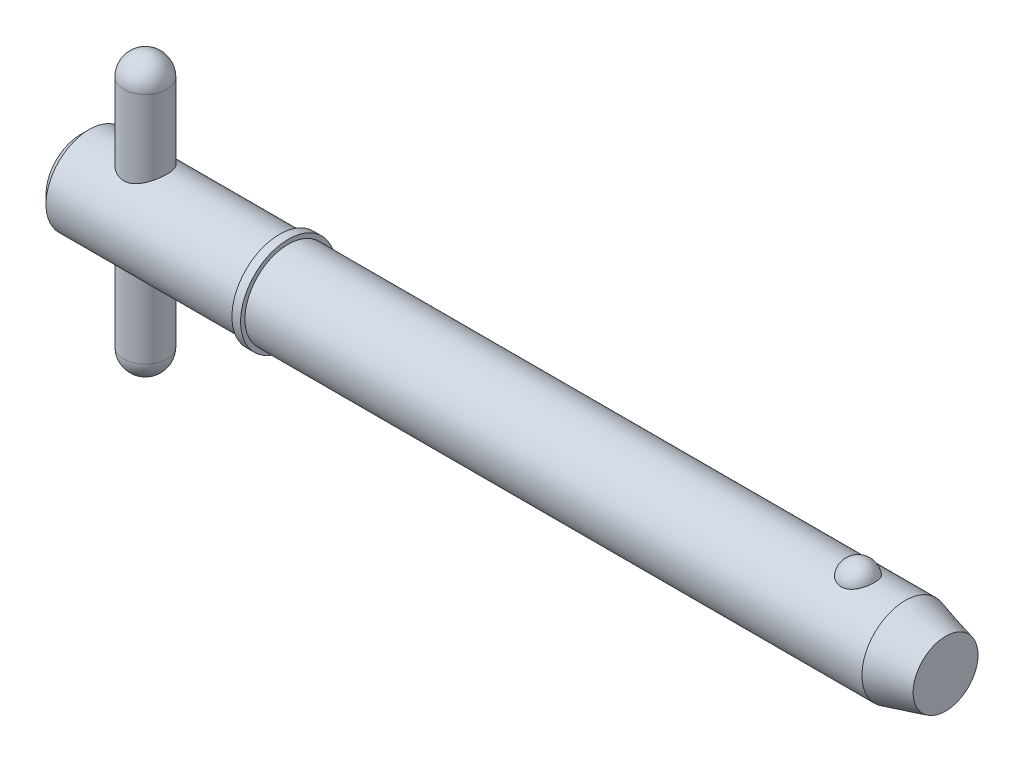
ISO-10303-21;
HEADER;
FILE_DESCRIPTION(('STEP AP214'),'2;1');
FILE_NAME('part.step','',(''),(''),'','','');
FILE_SCHEMA(('AUTOMOTIVE_DESIGN { 1 0 10303 214 1 1 1 1 }'));
ENDSEC;
DATA;
#1=APPLICATION_CONTEXT('core data for automotive mechanical design processes');
#2=APPLICATION_PROTOCOL_DEFINITION('international standard','automotive_design',2000,#1);
#3=PRODUCT_CONTEXT('',#1,'mechanical');
#4=PRODUCT('Part','Part','',(#3));
#5=PRODUCT_RELATED_PRODUCT_CATEGORY('part','',(#4));
#6=PRODUCT_DEFINITION_FORMATION('','',#4);
#7=PRODUCT_DEFINITION_CONTEXT('part definition',#1,'design');
#8=PRODUCT_DEFINITION('design','',#6,#7);
#9=PRODUCT_DEFINITION_SHAPE('','',#8);
#10=(LENGTH_UNIT() NAMED_UNIT(*) SI_UNIT(.MILLI.,.METRE.));
#11=(NAMED_UNIT(*) PLANE_ANGLE_UNIT() SI_UNIT($,.RADIAN.));
#12=(NAMED_UNIT(*) SI_UNIT($,.STERADIAN.) SOLID_ANGLE_UNIT());
#13=UNCERTAINTY_MEASURE_WITH_UNIT(LENGTH_MEASURE(1.E-05),#10,'distance_accuracy_value','');
#14=(GEOMETRIC_REPRESENTATION_CONTEXT(3) GLOBAL_UNCERTAINTY_ASSIGNED_CONTEXT((#13)) GLOBAL_UNIT_ASSIGNED_CONTEXT((#10,
#11,#12)) REPRESENTATION_CONTEXT('',''));
#15=CARTESIAN_POINT('',(0.,0.,0.));
#16=DIRECTION('',(0.,0.,1.));
#17=DIRECTION('',(1.,0.,0.));
#18=AXIS2_PLACEMENT_3D('',#15,#16,#17);
#19=CARTESIAN_POINT('',(5.94,12.7,0.));
#20=DIRECTION('',(0.,-1.,0.));
#21=DIRECTION('',(0.,0.,-1.));
#22=AXIS2_PLACEMENT_3D('',#19,#20,#21);
#23=CYLINDRICAL_SURFACE('',#22,1.98);
#24=CARTESIAN_POINT('',(5.94,-10.72,0.));
#25=DIRECTION('',(0.,-1.,0.));
#26=DIRECTION('',(0.,0.,-1.));
#27=AXIS2_PLACEMENT_3D('',#24,#25,#26);
#28=CIRCLE('',#27,1.98);
#29=CARTESIAN_POINT('',(5.94,-10.72,-1.98));
#30=VERTEX_POINT('',#29);
#31=EDGE_CURVE('P0_E10',#30,#30,#28,.F.);
#32=ORIENTED_EDGE('',*,*,#31,.T.);
#33=EDGE_LOOP('',(#32));
#34=FACE_BOUND('',#33,.T.);
#35=CARTESIAN_POINT('',(5.94,10.72,0.));
#36=DIRECTION('',(0.,-1.,0.));
#37=DIRECTION('',(0.,0.,-1.));
#38=AXIS2_PLACEMENT_3D('',#35,#36,#37);
#39=CIRCLE('',#38,1.98);
#40=CARTESIAN_POINT('',(5.94,10.72,-1.98));
#41=VERTEX_POINT('',#40);
#42=EDGE_CURVE('P0_E21',#41,#41,#39,.T.);
#43=ORIENTED_EDGE('',*,*,#42,.T.);
#44=EDGE_LOOP('',(#43));
#45=FACE_BOUND('',#44,.T.);
#46=ADVANCED_FACE('P0_F14',(#34,#45),#23,.T.);
#47=CARTESIAN_POINT('',(5.94,-10.72,0.));
#48=DIRECTION('',(0.,0.,1.));
#49=DIRECTION('',(1.,0.,0.));
#50=AXIS2_PLACEMENT_3D('',#47,#48,#49);
#51=SPHERICAL_SURFACE('',#50,1.98);
#52=CARTESIAN_POINT('',(5.94,-10.72,0.));
#53=DIRECTION('',(0.,-1.,0.));
#54=DIRECTION('',(0.,0.,-1.));
#55=AXIS2_PLACEMENT_3D('',#52,#53,#54);
#56=SPHERICAL_SURFACE('',#55,1.98);
#57=ORIENTED_EDGE('',*,*,#31,.F.);
#58=EDGE_LOOP('',(#57));
#59=FACE_BOUND('',#58,.T.);
#60=ADVANCED_FACE('P0_F29',(#59),#56,.T.);
#61=CARTESIAN_POINT('',(5.94,10.72,0.));
#62=DIRECTION('',(0.,0.,1.));
#63=DIRECTION('',(1.,0.,0.));
#64=AXIS2_PLACEMENT_3D('',#61,#62,#63);
#65=SPHERICAL_SURFACE('',#64,1.98);
#66=CARTESIAN_POINT('',(5.94,10.72,0.));
#67=DIRECTION('',(0.,-1.,0.));
#68=DIRECTION('',(0.,0.,-1.));
#69=AXIS2_PLACEMENT_3D('',#66,#67,#68);
#70=SPHERICAL_SURFACE('',#69,1.98);
#71=ORIENTED_EDGE('',*,*,#42,.F.);
#72=EDGE_LOOP('',(#71));
#73=FACE_BOUND('',#72,.T.);
#74=ADVANCED_FACE('P0_F16',(#73),#70,.T.);
#75=CLOSED_SHELL('',(#46,#60,#74));
#76=MANIFOLD_SOLID_BREP('P0_B1',#75);
#77=CARTESIAN_POINT('',(0.,0.,0.));
#78=DIRECTION('',(1.,0.,0.));
#79=DIRECTION('',(0.,0.,-1.));
#80=AXIS2_PLACEMENT_3D('',#77,#78,#79);
#81=CYLINDRICAL_SURFACE('',#80,3.97);
#82=CARTESIAN_POINT('',(75.6759395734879,0.,0.));
#83=DIRECTION('',(1.,0.,0.));
#84=DIRECTION('',(0.,0.,-1.));
#85=AXIS2_PLACEMENT_3D('',#82,#83,#84);
#86=CIRCLE('',#85,3.97);
#87=CARTESIAN_POINT('',(75.6759395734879,0.,-3.97));
#88=VERTEX_POINT('',#87);
#89=EDGE_CURVE('P1_E81',#88,#88,#86,.T.);
#90=ORIENTED_EDGE('',*,*,#89,.F.);
#91=EDGE_LOOP('',(#90));
#92=FACE_BOUND('',#91,.T.);
#93=CARTESIAN_POINT('',(19.05,0.,0.));
#94=DIRECTION('',(1.,0.,0.));
#95=DIRECTION('',(0.,0.,-1.));
#96=AXIS2_PLACEMENT_3D('',#93,#94,#95);
#97=CIRCLE('',#96,3.97);
#98=CARTESIAN_POINT('',(19.05,0.,-3.97));
#99=VERTEX_POINT('',#98);
#100=EDGE_CURVE('P1_E85',#99,#99,#97,.T.);
#101=ORIENTED_EDGE('',*,*,#100,.T.);
#102=EDGE_LOOP('',(#101));
#103=FACE_BOUND('',#102,.T.);
#104=CARTESIAN_POINT('',(71.3451922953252,3.65715365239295,1.54470941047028));
#105=CARTESIAN_POINT('',(71.2652448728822,3.65716001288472,1.54470290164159));
#106=CARTESIAN_POINT('',(71.1851650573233,3.65987074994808,1.53832549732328));
#107=CARTESIAN_POINT('',(71.0272374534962,3.6704221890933,1.51297018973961));
#108=CARTESIAN_POINT('',(70.9493961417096,3.67827646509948,1.49395894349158));
#109=CARTESIAN_POINT('',(70.7984614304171,3.69818848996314,1.44395950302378));
#110=CARTESIAN_POINT('',(70.7253560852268,3.71023513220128,1.41300293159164));
#111=CARTESIAN_POINT('',(70.5855630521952,3.7372183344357,1.34000212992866));
#112=CARTESIAN_POINT('',(70.5188725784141,3.75215363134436,1.29796274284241));
#113=CARTESIAN_POINT('',(70.3914886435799,3.78384968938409,1.20248834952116));
#114=CARTESIAN_POINT('',(70.3310299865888,3.80065129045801,1.14875388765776));
#115=CARTESIAN_POINT('',(70.2196942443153,3.83398532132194,1.03205417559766));
#116=CARTESIAN_POINT('',(70.1688200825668,3.85051766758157,0.969086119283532));
#117=CARTESIAN_POINT('',(70.0756321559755,3.88238608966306,0.832526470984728));
#118=CARTESIAN_POINT('',(70.0337961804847,3.89763698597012,0.75858832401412));
#119=CARTESIAN_POINT('',(69.9625108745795,3.92451063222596,0.60435211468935));
#120=CARTESIAN_POINT('',(69.9330623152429,3.93613315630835,0.524053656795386));
#121=CARTESIAN_POINT('',(69.8868927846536,3.95467606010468,0.358403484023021));
#122=CARTESIAN_POINT('',(69.8703127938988,3.96154426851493,0.273006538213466));
#123=CARTESIAN_POINT('',(69.850756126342,3.96967008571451,0.100408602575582));
#124=CARTESIAN_POINT('',(69.8477789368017,3.97092790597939,0.0132076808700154));
#125=CARTESIAN_POINT('',(69.8554587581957,3.96771794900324,-0.159844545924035));
#126=CARTESIAN_POINT('',(69.8660164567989,3.96329187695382,-0.245701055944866));
#127=CARTESIAN_POINT('',(69.9003800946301,3.94923163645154,-0.414277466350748));
#128=CARTESIAN_POINT('',(69.9241862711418,3.93959737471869,-0.496997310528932));
#129=CARTESIAN_POINT('',(69.9846114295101,3.91607752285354,-0.657113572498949));
#130=CARTESIAN_POINT('',(70.0212495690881,3.90218558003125,-0.734501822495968));
#131=CARTESIAN_POINT('',(70.1065935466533,3.87158287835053,-0.88170483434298));
#132=CARTESIAN_POINT('',(70.1553004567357,3.8548718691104,-0.951518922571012));
#133=CARTESIAN_POINT('',(70.2641161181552,3.82028735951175,-1.08208159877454));
#134=CARTESIAN_POINT('',(70.3242955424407,3.80240713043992,-1.14276958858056));
#135=CARTESIAN_POINT('',(70.454493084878,3.76758161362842,-1.2528243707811));
#136=CARTESIAN_POINT('',(70.5245105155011,3.75063626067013,-1.30219195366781));
#137=CARTESIAN_POINT('',(70.67118160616,3.71998948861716,-1.38729709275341));
#138=CARTESIAN_POINT('',(70.7476813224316,3.70623183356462,-1.42327904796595));
#139=CARTESIAN_POINT('',(70.9062981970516,3.68323188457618,-1.48178996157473));
#140=CARTESIAN_POINT('',(70.9884132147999,3.67398788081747,-1.5043240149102));
#141=CARTESIAN_POINT('',(71.1514810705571,3.6615216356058,-1.53440939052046));
#142=CARTESIAN_POINT('',(71.2322840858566,3.65801951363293,-1.54265826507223));
#143=CARTESIAN_POINT('',(71.3942085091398,3.65657341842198,-1.5460842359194));
#144=CARTESIAN_POINT('',(71.4753298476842,3.65862829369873,-1.54126404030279));
#145=CARTESIAN_POINT('',(71.6328122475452,3.66788969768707,-1.51908474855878));
#146=CARTESIAN_POINT('',(71.7092422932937,3.67492621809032,-1.50213925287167));
#147=CARTESIAN_POINT('',(71.8580412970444,3.69318404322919,-1.45666982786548));
#148=CARTESIAN_POINT('',(71.9304099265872,3.70440568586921,-1.42814496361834));
#149=CARTESIAN_POINT('',(72.0708029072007,3.73012749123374,-1.35956319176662));
#150=CARTESIAN_POINT('',(72.1387000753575,3.74469307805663,-1.31927107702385));
#151=CARTESIAN_POINT('',(72.2668649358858,3.77545272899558,-1.22847440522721));
#152=CARTESIAN_POINT('',(72.3271308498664,3.79164717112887,-1.17796747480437));
#153=CARTESIAN_POINT('',(72.4416346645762,3.82490325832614,-1.06519260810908));
#154=CARTESIAN_POINT('',(72.4954137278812,3.84196735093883,-1.00245914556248));
#155=CARTESIAN_POINT('',(72.5920988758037,3.87439863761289,-0.868715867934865));
#156=CARTESIAN_POINT('',(72.6350030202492,3.88976552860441,-0.797704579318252));
#157=CARTESIAN_POINT('',(72.710266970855,3.91771381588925,-0.646896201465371));
#158=CARTESIAN_POINT('',(72.7422532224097,3.93019255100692,-0.566893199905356));
#159=CARTESIAN_POINT('',(72.7931101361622,3.95043886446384,-0.402255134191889));
#160=CARTESIAN_POINT('',(72.8119807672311,3.95820643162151,-0.31762005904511));
#161=CARTESIAN_POINT('',(72.8362162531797,3.96823733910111,-0.146156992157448));
#162=CARTESIAN_POINT('',(72.8415874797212,3.97050327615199,-0.0593300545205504));
#163=CARTESIAN_POINT('',(72.8387309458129,3.96930811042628,0.114057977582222));
#164=CARTESIAN_POINT('',(72.830503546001,3.9658471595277,0.200619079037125));
#165=CARTESIAN_POINT('',(72.8007063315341,3.95358562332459,0.370506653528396));
#166=CARTESIAN_POINT('',(72.7792129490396,3.94481563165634,0.453848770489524));
#167=CARTESIAN_POINT('',(72.7233839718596,3.92284586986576,0.615497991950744));
#168=CARTESIAN_POINT('',(72.6890474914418,3.90964579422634,0.69380474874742));
#169=CARTESIAN_POINT('',(72.6079702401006,3.88006987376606,0.843703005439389));
#170=CARTESIAN_POINT('',(72.5611536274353,3.86367478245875,0.915249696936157));
#171=CARTESIAN_POINT('',(72.4561897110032,3.82949741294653,1.04910810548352));
#172=CARTESIAN_POINT('',(72.3980428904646,3.81171519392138,1.11142021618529));
#173=CARTESIAN_POINT('',(72.2717433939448,3.77673366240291,1.22503948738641));
#174=CARTESIAN_POINT('',(72.2035970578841,3.75953398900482,1.27635357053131));
#175=CARTESIAN_POINT('',(72.0589009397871,3.72770506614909,1.36653336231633));
#176=CARTESIAN_POINT('',(71.982348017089,3.71307678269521,1.40539439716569));
#177=CARTESIAN_POINT('',(71.8257594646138,3.68864287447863,1.46830480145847));
#178=CARTESIAN_POINT('',(71.7459307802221,3.67869017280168,1.49281289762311));
#179=CARTESIAN_POINT('',(71.5829877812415,3.66414535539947,1.52817474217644));
#180=CARTESIAN_POINT('',(71.4998840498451,3.65953723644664,1.53906926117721));
#181=CARTESIAN_POINT('',(71.3927760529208,3.6573894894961,1.54414878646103));
#182=CARTESIAN_POINT('',(71.3689900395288,3.65715175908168,1.54471134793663));
#183=CARTESIAN_POINT('',(71.3451922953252,3.65715365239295,1.54470941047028));
#184=B_SPLINE_CURVE_WITH_KNOTS('',3,(#104,#105,#106,#107,#108,#109,#110,#111,#112,#113,#114,
#115,#116,#117,#118,#119,#120,#121,#122,#123,#124,#125,#126,#127,#128,#129,#130,#131,#132,#133,
#134,#135,#136,#137,#138,#139,#140,#141,#142,#143,#144,#145,#146,#147,#148,#149,#150,#151,#152,
#153,#154,#155,#156,#157,#158,#159,#160,#161,#162,#163,#164,#165,#166,#167,#168,#169,#170,#171,
#172,#173,#174,#175,#176,#177,#178,#179,#180,#181,#182,#183),.UNSPECIFIED.,.T.,.F.,(4,2,2,2,2,2,
2,2,2,2,2,2,2,2,2,2,2,2,2,2,2,2,2,2,2,2,2,2,2,2,2,2,2,2,2,2,2,2,2,4),(0.,0.239777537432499,
0.480190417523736,0.719971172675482,0.959647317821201,1.20639040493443,1.45320863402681,
1.7109367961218,1.96868099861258,2.22921052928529,2.48973023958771,2.74834928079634,
3.00697295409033,3.26598440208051,3.52501886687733,3.78570385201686,4.04637062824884,
4.30201257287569,4.5575576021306,4.80022994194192,5.04285200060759,5.27757006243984,
5.51230707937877,5.75210128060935,5.99195126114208,6.24392810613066,6.49594987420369,
6.75588818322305,7.01582710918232,7.27564332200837,7.53545264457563,7.79377886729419,
8.0521229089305,8.31207418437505,8.57201437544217,8.83179046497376,9.09166393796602,
9.34270057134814,9.59298357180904,9.66435753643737),.UNSPECIFIED.);
#185=CARTESIAN_POINT('',(71.3451922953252,3.65715365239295,1.54470941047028));
#186=VERTEX_POINT('',#185);
#187=EDGE_CURVE('P1_E35',#186,#186,#184,.T.);
#188=ORIENTED_EDGE('',*,*,#187,.T.);
#189=EDGE_LOOP('',(#188));
#190=FACE_BOUND('',#189,.T.);
#191=ADVANCED_FACE('P1_F13',(#92,#103,#190),#81,.T.);
#192=CARTESIAN_POINT('',(0.,0.,0.));
#193=DIRECTION('',(-1.,0.,0.));
#194=DIRECTION('',(0.,0.,1.));
#195=AXIS2_PLACEMENT_3D('',#192,#193,#194);
#196=PLANE('',#195);
#197=CARTESIAN_POINT('',(0.,0.,0.));
#198=DIRECTION('',(1.,0.,0.));
#199=DIRECTION('',(0.,0.,-1.));
#200=AXIS2_PLACEMENT_3D('',#197,#198,#199);
#201=CIRCLE('',#200,3.176);
#202=CARTESIAN_POINT('',(0.,0.,-3.176));
#203=VERTEX_POINT('',#202);
#204=EDGE_CURVE('P1_E9',#203,#203,#201,.T.);
#205=ORIENTED_EDGE('',*,*,#204,.F.);
#206=EDGE_LOOP('',(#205));
#207=FACE_BOUND('',#206,.T.);
#208=ADVANCED_FACE('P1_F15',(#207),#196,.T.);
#209=CARTESIAN_POINT('',(0.793999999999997,0.,0.));
#210=DIRECTION('',(1.,0.,0.));
#211=DIRECTION('',(0.,0.,-1.));
#212=AXIS2_PLACEMENT_3D('',#209,#210,#211);
#213=CONICAL_SURFACE('',#212,3.97,0.78539816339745);
#214=ORIENTED_EDGE('',*,*,#204,.T.);
#215=EDGE_LOOP('',(#214));
#216=FACE_BOUND('',#215,.T.);
#217=CARTESIAN_POINT('',(0.793999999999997,0.,0.));
#218=DIRECTION('',(1.,0.,0.));
#219=DIRECTION('',(0.,0.,-1.));
#220=AXIS2_PLACEMENT_3D('',#217,#218,#219);
#221=CIRCLE('',#220,3.97);
#222=CARTESIAN_POINT('',(0.793999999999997,0.,-3.97));
#223=VERTEX_POINT('',#222);
#224=EDGE_CURVE('P1_E26',#223,#223,#221,.T.);
#225=ORIENTED_EDGE('',*,*,#224,.F.);
#226=EDGE_LOOP('',(#225));
#227=FACE_BOUND('',#226,.T.);
#228=ADVANCED_FACE('P1_F77',(#216,#227),#213,.T.);
#229=CARTESIAN_POINT('',(0.,0.,0.));
#230=DIRECTION('',(1.,0.,0.));
#231=DIRECTION('',(0.,0.,-1.));
#232=AXIS2_PLACEMENT_3D('',#229,#230,#231);
#233=CYLINDRICAL_SURFACE('',#232,3.97);
#234=CARTESIAN_POINT('',(5.94,-3.44100276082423,1.98));
#235=CARTESIAN_POINT('',(5.8367885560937,-3.44101282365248,1.97999171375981));
#236=CARTESIAN_POINT('',(5.73344176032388,-3.44571749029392,1.97187534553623));
#237=CARTESIAN_POINT('',(5.52991905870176,-3.46385873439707,1.93981946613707));
#238=CARTESIAN_POINT('',(5.42975031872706,-3.47731375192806,1.91584653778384));
#239=CARTESIAN_POINT('',(5.23590869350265,-3.51100678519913,1.85336773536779));
#240=CARTESIAN_POINT('',(5.14220446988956,-3.53120882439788,1.81493880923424));
#241=CARTESIAN_POINT('',(4.9625969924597,-3.57606420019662,1.72487335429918));
#242=CARTESIAN_POINT('',(4.87669412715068,-3.6007177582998,1.67323616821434));
#243=CARTESIAN_POINT('',(4.70734412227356,-3.65417020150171,1.55325205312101));
#244=CARTESIAN_POINT('',(4.62467662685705,-3.68314323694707,1.4838818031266));
#245=CARTESIAN_POINT('',(4.47154355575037,-3.74056406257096,1.33252902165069));
#246=CARTESIAN_POINT('',(4.40108404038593,-3.76901158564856,1.25054026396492));
#247=CARTESIAN_POINT('',(4.26974803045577,-3.82445556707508,1.06956584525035));
#248=CARTESIAN_POINT('',(4.20982960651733,-3.8512271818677,0.969809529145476));
#249=CARTESIAN_POINT('',(4.10798077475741,-3.89804342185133,0.760047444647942));
#250=CARTESIAN_POINT('',(4.06603907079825,-3.91809226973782,0.650048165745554));
#251=CARTESIAN_POINT('',(4.00441878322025,-3.94794912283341,0.431181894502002));
#252=CARTESIAN_POINT('',(3.98337329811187,-3.95838209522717,0.322786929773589));
#253=CARTESIAN_POINT('',(3.9596425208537,-3.97016407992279,0.103541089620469));
#254=CARTESIAN_POINT('',(3.95694618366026,-3.97151855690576,-0.00730826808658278));
#255=CARTESIAN_POINT('',(3.9694599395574,-3.96528826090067,-0.218044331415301));
#256=CARTESIAN_POINT('',(3.98314071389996,-3.95846689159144,-0.318049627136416));
#257=CARTESIAN_POINT('',(4.02528522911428,-3.93780347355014,-0.514124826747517));
#258=CARTESIAN_POINT('',(4.05375007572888,-3.92396089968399,-0.61019443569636));
#259=CARTESIAN_POINT('',(4.12484256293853,-3.89028355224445,-0.797351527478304));
#260=CARTESIAN_POINT('',(4.16766142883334,-3.87036821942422,-0.888351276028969));
#261=CARTESIAN_POINT('',(4.26598377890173,-3.82634285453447,-1.06209448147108));
#262=CARTESIAN_POINT('',(4.32149181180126,-3.8022313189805,-1.14483496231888));
#263=CARTESIAN_POINT('',(4.44962332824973,-3.74940011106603,-1.30802500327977));
#264=CARTESIAN_POINT('',(4.52336636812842,-3.72046031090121,-1.38752498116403));
#265=CARTESIAN_POINT('',(4.68287656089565,-3.66269463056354,-1.53354043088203));
#266=CARTESIAN_POINT('',(4.7686527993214,-3.63386885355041,-1.60004599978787));
#267=CARTESIAN_POINT('',(4.9564069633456,-3.57763161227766,-1.72228426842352));
#268=CARTESIAN_POINT('',(5.05906485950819,-3.5504233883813,-1.77707534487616));
#269=CARTESIAN_POINT('',(5.27381412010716,-3.50334038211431,-1.86819784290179));
#270=CARTESIAN_POINT('',(5.38589553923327,-3.48345798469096,-1.90454844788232));
#271=CARTESIAN_POINT('',(5.6069795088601,-3.45548331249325,-1.95481643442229));
#272=CARTESIAN_POINT('',(5.71552407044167,-3.44658268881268,-1.97028113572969));
#273=CARTESIAN_POINT('',(5.93399639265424,-3.43928114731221,-1.98300600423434));
#274=CARTESIAN_POINT('',(6.04392313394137,-3.44087289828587,-1.98027888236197));
#275=CARTESIAN_POINT('',(6.24931618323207,-3.45351901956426,-1.95811780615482));
#276=CARTESIAN_POINT('',(6.34505668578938,-3.46352725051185,-1.94052989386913));
#277=CARTESIAN_POINT('',(6.53204702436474,-3.49033612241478,-1.89188242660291));
#278=CARTESIAN_POINT('',(6.62329540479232,-3.50713894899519,-1.86081853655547));
#279=CARTESIAN_POINT('',(6.80352105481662,-3.54655680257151,-1.78458666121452));
#280=CARTESIAN_POINT('',(6.89219712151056,-3.56940508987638,-1.73883178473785));
#281=CARTESIAN_POINT('',(7.06112449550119,-3.61813012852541,-1.63502913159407));
#282=CARTESIAN_POINT('',(7.14137144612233,-3.6440084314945,-1.57697504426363));
#283=CARTESIAN_POINT('',(7.30168083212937,-3.69977514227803,-1.44171920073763));
#284=CARTESIAN_POINT('',(7.38046039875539,-3.7297597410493,-1.36302972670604));
#285=CARTESIAN_POINT('',(7.52409649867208,-3.78754991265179,-1.19307190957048));
#286=CARTESIAN_POINT('',(7.58894840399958,-3.81535475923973,-1.10179940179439));
#287=CARTESIAN_POINT('',(7.70430122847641,-3.86658972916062,-0.906019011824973));
#288=CARTESIAN_POINT('',(7.75438714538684,-3.88988795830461,-0.801229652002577));
#289=CARTESIAN_POINT('',(7.83572184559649,-3.92848199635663,-0.583216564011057));
#290=CARTESIAN_POINT('',(7.86698708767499,-3.94378479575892,-0.470000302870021));
#291=CARTESIAN_POINT('',(7.90711051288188,-3.96355307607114,-0.249525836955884));
#292=CARTESIAN_POINT('',(7.91775648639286,-3.96888171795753,-0.142669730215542));
#293=CARTESIAN_POINT('',(7.92160247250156,-3.97079858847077,0.0714191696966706));
#294=CARTESIAN_POINT('',(7.91480852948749,-3.96738984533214,0.178651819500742));
#295=CARTESIAN_POINT('',(7.88515479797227,-3.9527181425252,0.383072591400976));
#296=CARTESIAN_POINT('',(7.8633739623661,-3.94198303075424,0.480459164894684));
#297=CARTESIAN_POINT('',(7.80581513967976,-3.91422178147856,0.670038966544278));
#298=CARTESIAN_POINT('',(7.77003513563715,-3.89719473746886,0.762231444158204));
#299=CARTESIAN_POINT('',(7.68389191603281,-3.85747818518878,0.943248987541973));
#300=CARTESIAN_POINT('',(7.63296879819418,-3.83457704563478,1.03175978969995));
#301=CARTESIAN_POINT('',(7.51869140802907,-3.7855122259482,1.19934744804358));
#302=CARTESIAN_POINT('',(7.45533142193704,-3.75934704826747,1.2784199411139));
#303=CARTESIAN_POINT('',(7.31068939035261,-3.70329841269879,1.433144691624));
#304=CARTESIAN_POINT('',(7.22825362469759,-3.67330340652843,1.50768183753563));
#305=CARTESIAN_POINT('',(7.05162367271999,-3.61514025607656,1.64226879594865));
#306=CARTESIAN_POINT('',(6.95741928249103,-3.58697372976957,1.70230590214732));
#307=CARTESIAN_POINT('',(6.75590859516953,-3.53504049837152,1.80775364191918));
#308=CARTESIAN_POINT('',(6.64828786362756,-3.51143624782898,1.85265616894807));
#309=CARTESIAN_POINT('',(6.48137774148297,-3.48289659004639,1.90544537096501));
#310=CARTESIAN_POINT('',(6.42488151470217,-3.4745323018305,1.9206071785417));
#311=CARTESIAN_POINT('',(6.31046920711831,-3.4604244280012,1.94591259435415));
#312=CARTESIAN_POINT('',(6.25255415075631,-3.45467900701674,1.95605971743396));
#313=CARTESIAN_POINT('',(6.1521444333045,-3.44728060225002,1.96905939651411));
#314=CARTESIAN_POINT('',(6.10985721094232,-3.44493297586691,1.97315742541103));
#315=CARTESIAN_POINT('',(6.02505433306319,-3.44179192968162,1.97862952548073));
#316=CARTESIAN_POINT('',(5.98253866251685,-3.44099861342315,1.98000341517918));
#317=CARTESIAN_POINT('',(5.94,-3.44100276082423,1.98));
#318=B_SPLINE_CURVE_WITH_KNOTS('',3,(#234,#235,#236,#237,#238,#239,#240,#241,#242,#243,#244,
#245,#246,#247,#248,#249,#250,#251,#252,#253,#254,#255,#256,#257,#258,#259,#260,#261,#262,#263,
#264,#265,#266,#267,#268,#269,#270,#271,#272,#273,#274,#275,#276,#277,#278,#279,#280,#281,#282,
#283,#284,#285,#286,#287,#288,#289,#290,#291,#292,#293,#294,#295,#296,#297,#298,#299,#300,#301,
#302,#303,#304,#305,#306,#307,#308,#309,#310,#311,#312,#313,#314,#315,#316,#317),.UNSPECIFIED.,
.T.,.F.,(4,2,2,2,2,2,2,2,2,2,2,2,2,2,2,2,2,2,2,2,2,2,2,2,2,2,2,2,2,2,2,2,2,2,2,2,2,2,2,2,2,4),
(0.,0.309462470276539,0.619579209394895,0.928068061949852,1.23657226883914,1.57038619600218,
1.90436536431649,2.26071614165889,2.61684266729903,2.94773555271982,3.27842924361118,
3.58050679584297,3.88260694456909,4.18890317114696,4.49530936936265,4.83057163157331,
5.1660884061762,5.52272472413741,5.87898927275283,6.20706708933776,6.53491569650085,
6.82716910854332,7.11951660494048,7.42541184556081,7.73146442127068,8.07586334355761,
8.42037652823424,8.77380887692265,9.12693169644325,9.44775848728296,9.76847409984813,
10.0682302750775,10.3680296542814,10.6806938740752,10.9935020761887,11.3373031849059,
11.6814044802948,12.0361164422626,12.2131519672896,12.3900632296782,12.5175998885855,
12.6451450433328),.UNSPECIFIED.);
#319=CARTESIAN_POINT('',(5.94,-3.44100276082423,1.98));
#320=VERTEX_POINT('',#319);
#321=EDGE_CURVE('P1_E17',#320,#320,#318,.T.);
#322=ORIENTED_EDGE('',*,*,#321,.F.);
#323=EDGE_LOOP('',(#322));
#324=FACE_BOUND('',#323,.T.);
#325=CARTESIAN_POINT('',(5.94,3.44100276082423,1.98));
#326=CARTESIAN_POINT('',(6.0432114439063,3.44101282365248,1.97999171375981));
#327=CARTESIAN_POINT('',(6.14655823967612,3.44571749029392,1.97187534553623));
#328=CARTESIAN_POINT('',(6.35008094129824,3.46385873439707,1.93981946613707));
#329=CARTESIAN_POINT('',(6.45024968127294,3.47731375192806,1.91584653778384));
#330=CARTESIAN_POINT('',(6.64409130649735,3.51100678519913,1.85336773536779));
#331=CARTESIAN_POINT('',(6.73779553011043,3.53120882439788,1.81493880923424));
#332=CARTESIAN_POINT('',(6.91740300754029,3.57606420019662,1.72487335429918));
#333=CARTESIAN_POINT('',(7.00330587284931,3.6007177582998,1.67323616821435));
#334=CARTESIAN_POINT('',(7.17265587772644,3.65417020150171,1.55325205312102));
#335=CARTESIAN_POINT('',(7.25532337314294,3.68314323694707,1.4838818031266));
#336=CARTESIAN_POINT('',(7.40845644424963,3.74056406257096,1.3325290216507));
#337=CARTESIAN_POINT('',(7.47891595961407,3.76901158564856,1.25054026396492));
#338=CARTESIAN_POINT('',(7.61025196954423,3.82445556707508,1.06956584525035));
#339=CARTESIAN_POINT('',(7.67017039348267,3.8512271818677,0.969809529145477));
#340=CARTESIAN_POINT('',(7.77201922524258,3.89804342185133,0.760047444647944));
#341=CARTESIAN_POINT('',(7.81396092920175,3.91809226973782,0.650048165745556));
#342=CARTESIAN_POINT('',(7.87558121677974,3.94794912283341,0.431181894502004));
#343=CARTESIAN_POINT('',(7.89662670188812,3.95838209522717,0.322786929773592));
#344=CARTESIAN_POINT('',(7.9203574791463,3.97016407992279,0.103541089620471));
#345=CARTESIAN_POINT('',(7.92305381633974,3.97151855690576,-0.00730826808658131));
#346=CARTESIAN_POINT('',(7.9105400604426,3.96528826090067,-0.2180443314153));
#347=CARTESIAN_POINT('',(7.89685928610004,3.95846689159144,-0.318049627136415));
#348=CARTESIAN_POINT('',(7.85471477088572,3.93780347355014,-0.514124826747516));
#349=CARTESIAN_POINT('',(7.82624992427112,3.92396089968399,-0.61019443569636));
#350=CARTESIAN_POINT('',(7.75515743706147,3.89028355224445,-0.797351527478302));
#351=CARTESIAN_POINT('',(7.71233857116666,3.87036821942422,-0.888351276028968));
#352=CARTESIAN_POINT('',(7.61401622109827,3.82634285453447,-1.06209448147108));
#353=CARTESIAN_POINT('',(7.55850818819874,3.8022313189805,-1.14483496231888));
#354=CARTESIAN_POINT('',(7.43037667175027,3.74940011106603,-1.30802500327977));
#355=CARTESIAN_POINT('',(7.35663363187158,3.72046031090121,-1.38752498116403));
#356=CARTESIAN_POINT('',(7.19712343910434,3.66269463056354,-1.53354043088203));
#357=CARTESIAN_POINT('',(7.1113472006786,3.63386885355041,-1.60004599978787));
#358=CARTESIAN_POINT('',(6.9235930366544,3.57763161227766,-1.72228426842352));
#359=CARTESIAN_POINT('',(6.82093514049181,3.5504233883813,-1.77707534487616));
#360=CARTESIAN_POINT('',(6.60618587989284,3.50334038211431,-1.86819784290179));
#361=CARTESIAN_POINT('',(6.49410446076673,3.48345798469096,-1.90454844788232));
#362=CARTESIAN_POINT('',(6.2730204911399,3.45548331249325,-1.95481643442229));
#363=CARTESIAN_POINT('',(6.16447592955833,3.44658268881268,-1.97028113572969));
#364=CARTESIAN_POINT('',(5.94600360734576,3.43928114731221,-1.98300600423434));
#365=CARTESIAN_POINT('',(5.83607686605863,3.44087289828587,-1.98027888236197));
#366=CARTESIAN_POINT('',(5.63068381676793,3.45351901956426,-1.95811780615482));
#367=CARTESIAN_POINT('',(5.53494331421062,3.46352725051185,-1.94052989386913));
#368=CARTESIAN_POINT('',(5.34795297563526,3.49033612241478,-1.89188242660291));
#369=CARTESIAN_POINT('',(5.25670459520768,3.50713894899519,-1.86081853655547));
#370=CARTESIAN_POINT('',(5.07647894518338,3.54655680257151,-1.78458666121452));
#371=CARTESIAN_POINT('',(4.98780287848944,3.56940508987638,-1.73883178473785));
#372=CARTESIAN_POINT('',(4.81887550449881,3.61813012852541,-1.63502913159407));
#373=CARTESIAN_POINT('',(4.73862855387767,3.6440084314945,-1.57697504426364));
#374=CARTESIAN_POINT('',(4.57831916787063,3.69977514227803,-1.44171920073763));
#375=CARTESIAN_POINT('',(4.49953960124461,3.7297597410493,-1.36302972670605));
#376=CARTESIAN_POINT('',(4.35590350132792,3.78754991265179,-1.19307190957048));
#377=CARTESIAN_POINT('',(4.29105159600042,3.81535475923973,-1.10179940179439));
#378=CARTESIAN_POINT('',(4.17569877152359,3.86658972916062,-0.906019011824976));
#379=CARTESIAN_POINT('',(4.12561285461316,3.88988795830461,-0.80122965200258));
#380=CARTESIAN_POINT('',(4.04427815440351,3.92848199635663,-0.58321656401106));
#381=CARTESIAN_POINT('',(4.01301291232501,3.94378479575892,-0.470000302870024));
#382=CARTESIAN_POINT('',(3.97288948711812,3.96355307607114,-0.249525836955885));
#383=CARTESIAN_POINT('',(3.96224351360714,3.96888171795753,-0.142669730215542));
#384=CARTESIAN_POINT('',(3.95839752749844,3.97079858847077,0.0714191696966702));
#385=CARTESIAN_POINT('',(3.96519147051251,3.96738984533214,0.178651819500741));
#386=CARTESIAN_POINT('',(3.99484520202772,3.9527181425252,0.383072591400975));
#387=CARTESIAN_POINT('',(4.01662603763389,3.94198303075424,0.480459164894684));
#388=CARTESIAN_POINT('',(4.07418486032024,3.91422178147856,0.670038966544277));
#389=CARTESIAN_POINT('',(4.10996486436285,3.89719473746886,0.762231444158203));
#390=CARTESIAN_POINT('',(4.19610808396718,3.85747818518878,0.943248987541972));
#391=CARTESIAN_POINT('',(4.24703120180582,3.83457704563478,1.03175978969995));
#392=CARTESIAN_POINT('',(4.36130859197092,3.7855122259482,1.19934744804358));
#393=CARTESIAN_POINT('',(4.42466857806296,3.75934704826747,1.2784199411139));
#394=CARTESIAN_POINT('',(4.56931060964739,3.70329841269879,1.433144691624));
#395=CARTESIAN_POINT('',(4.65174637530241,3.67330340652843,1.50768183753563));
#396=CARTESIAN_POINT('',(4.82837632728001,3.61514025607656,1.64226879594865));
#397=CARTESIAN_POINT('',(4.92258071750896,3.58697372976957,1.70230590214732));
#398=CARTESIAN_POINT('',(5.12409140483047,3.53504049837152,1.80775364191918));
#399=CARTESIAN_POINT('',(5.23171213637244,3.51143624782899,1.85265616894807));
#400=CARTESIAN_POINT('',(5.39862225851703,3.48289659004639,1.90544537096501));
#401=CARTESIAN_POINT('',(5.45511848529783,3.4745323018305,1.9206071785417));
#402=CARTESIAN_POINT('',(5.56953079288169,3.4604244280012,1.94591259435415));
#403=CARTESIAN_POINT('',(5.62744584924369,3.45467900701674,1.95605971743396));
#404=CARTESIAN_POINT('',(5.7278555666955,3.44728060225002,1.9690593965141));
#405=CARTESIAN_POINT('',(5.77014278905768,3.44493297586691,1.97315742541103));
#406=CARTESIAN_POINT('',(5.85494566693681,3.44179192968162,1.97862952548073));
#407=CARTESIAN_POINT('',(5.89746133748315,3.44099861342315,1.98000341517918));
#408=CARTESIAN_POINT('',(5.94,3.44100276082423,1.98));
#409=B_SPLINE_CURVE_WITH_KNOTS('',3,(#325,#326,#327,#328,#329,#330,#331,#332,#333,#334,#335,
#336,#337,#338,#339,#340,#341,#342,#343,#344,#345,#346,#347,#348,#349,#350,#351,#352,#353,#354,
#355,#356,#357,#358,#359,#360,#361,#362,#363,#364,#365,#366,#367,#368,#369,#370,#371,#372,#373,
#374,#375,#376,#377,#378,#379,#380,#381,#382,#383,#384,#385,#386,#387,#388,#389,#390,#391,#392,
#393,#394,#395,#396,#397,#398,#399,#400,#401,#402,#403,#404,#405,#406,#407,#408),.UNSPECIFIED.,
.T.,.F.,(4,2,2,2,2,2,2,2,2,2,2,2,2,2,2,2,2,2,2,2,2,2,2,2,2,2,2,2,2,2,2,2,2,2,2,2,2,2,2,2,2,4),
(0.,0.309462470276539,0.619579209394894,0.928068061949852,1.23657226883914,1.57038619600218,
1.90436536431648,2.26071614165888,2.61684266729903,2.94773555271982,3.27842924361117,
3.58050679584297,3.88260694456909,4.18890317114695,4.49530936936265,4.83057163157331,
5.1660884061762,5.5227247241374,5.87898927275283,6.20706708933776,6.53491569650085,
6.82716910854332,7.11951660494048,7.42541184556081,7.73146442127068,8.07586334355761,
8.42037652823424,8.77380887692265,9.12693169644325,9.44775848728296,9.76847409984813,
10.0682302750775,10.3680296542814,10.6806938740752,10.9935020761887,11.3373031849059,
11.6814044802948,12.0361164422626,12.2131519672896,12.3900632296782,12.5175998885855,
12.6451450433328),.UNSPECIFIED.);
#410=CARTESIAN_POINT('',(5.94,3.44100276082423,1.98));
#411=VERTEX_POINT('',#410);
#412=EDGE_CURVE('P1_E43',#411,#411,#409,.T.);
#413=ORIENTED_EDGE('',*,*,#412,.F.);
#414=EDGE_LOOP('',(#413));
#415=FACE_BOUND('',#414,.T.);
#416=ORIENTED_EDGE('',*,*,#224,.T.);
#417=EDGE_LOOP('',(#416));
#418=FACE_BOUND('',#417,.T.);
#419=CARTESIAN_POINT('',(18.256,0.,0.));
#420=DIRECTION('',(1.,0.,0.));
#421=DIRECTION('',(0.,0.,-1.));
#422=AXIS2_PLACEMENT_3D('',#419,#420,#421);
#423=CIRCLE('',#422,3.97);
#424=CARTESIAN_POINT('',(18.256,0.,-3.97));
#425=VERTEX_POINT('',#424);
#426=EDGE_CURVE('P1_E31',#425,#425,#423,.T.);
#427=ORIENTED_EDGE('',*,*,#426,.F.);
#428=EDGE_LOOP('',(#427));
#429=FACE_BOUND('',#428,.T.);
#430=ADVANCED_FACE('P1_F103',(#324,#415,#418,#429),#233,.T.);
#431=CARTESIAN_POINT('',(18.256,3.97,0.));
#432=DIRECTION('',(-1.,0.,0.));
#433=DIRECTION('',(0.,0.,1.));
#434=AXIS2_PLACEMENT_3D('',#431,#432,#433);
#435=PLANE('',#434);
#436=ORIENTED_EDGE('',*,*,#426,.T.);
#437=EDGE_LOOP('',(#436));
#438=FACE_BOUND('',#437,.T.);
#439=CARTESIAN_POINT('',(18.256,0.,0.));
#440=DIRECTION('',(1.,0.,0.));
#441=DIRECTION('',(0.,0.,-1.));
#442=AXIS2_PLACEMENT_3D('',#439,#440,#441);
#443=CIRCLE('',#442,4.367);
#444=CARTESIAN_POINT('',(18.256,0.,-4.367));
#445=VERTEX_POINT('',#444);
#446=EDGE_CURVE('P1_E91',#445,#445,#443,.T.);
#447=ORIENTED_EDGE('',*,*,#446,.F.);
#448=EDGE_LOOP('',(#447));
#449=FACE_BOUND('',#448,.T.);
#450=ADVANCED_FACE('P1_F100',(#438,#449),#435,.T.);
#451=CARTESIAN_POINT('',(0.,0.,0.));
#452=DIRECTION('',(1.,0.,0.));
#453=DIRECTION('',(0.,0.,-1.));
#454=AXIS2_PLACEMENT_3D('',#451,#452,#453);
#455=CYLINDRICAL_SURFACE('',#454,4.367);
#456=ORIENTED_EDGE('',*,*,#446,.T.);
#457=EDGE_LOOP('',(#456));
#458=FACE_BOUND('',#457,.T.);
#459=CARTESIAN_POINT('',(19.05,0.,0.));
#460=DIRECTION('',(1.,0.,0.));
#461=DIRECTION('',(0.,0.,-1.));
#462=AXIS2_PLACEMENT_3D('',#459,#460,#461);
#463=CIRCLE('',#462,4.367);
#464=CARTESIAN_POINT('',(19.05,0.,-4.367));
#465=VERTEX_POINT('',#464);
#466=EDGE_CURVE('P1_E88',#465,#465,#463,.T.);
#467=ORIENTED_EDGE('',*,*,#466,.F.);
#468=EDGE_LOOP('',(#467));
#469=FACE_BOUND('',#468,.T.);
#470=ADVANCED_FACE('P1_F68',(#458,#469),#455,.T.);
#471=CARTESIAN_POINT('',(19.05,4.367,0.));
#472=DIRECTION('',(1.,0.,0.));
#473=DIRECTION('',(0.,0.,-1.));
#474=AXIS2_PLACEMENT_3D('',#471,#472,#473);
#475=PLANE('',#474);
#476=ORIENTED_EDGE('',*,*,#466,.T.);
#477=EDGE_LOOP('',(#476));
#478=FACE_BOUND('',#477,.T.);
#479=ORIENTED_EDGE('',*,*,#100,.F.);
#480=EDGE_LOOP('',(#479));
#481=FACE_BOUND('',#480,.T.);
#482=ADVANCED_FACE('P1_F62',(#478,#481),#475,.T.);
#483=CARTESIAN_POINT('',(79.38,0.,0.));
#484=DIRECTION('',(-1.,0.,0.));
#485=DIRECTION('',(0.,0.,1.));
#486=AXIS2_PLACEMENT_3D('',#483,#484,#485);
#487=CONICAL_SURFACE('',#486,2.97750000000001,0.261799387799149);
#488=ORIENTED_EDGE('',*,*,#89,.T.);
#489=EDGE_LOOP('',(#488));
#490=FACE_BOUND('',#489,.T.);
#491=CARTESIAN_POINT('',(79.38,0.,0.));
#492=DIRECTION('',(1.,0.,0.));
#493=DIRECTION('',(0.,0.,-1.));
#494=AXIS2_PLACEMENT_3D('',#491,#492,#493);
#495=CIRCLE('',#494,2.97750000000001);
#496=CARTESIAN_POINT('',(79.38,0.,-2.97750000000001));
#497=VERTEX_POINT('',#496);
#498=EDGE_CURVE('P1_E42',#497,#497,#495,.T.);
#499=ORIENTED_EDGE('',*,*,#498,.F.);
#500=EDGE_LOOP('',(#499));
#501=FACE_BOUND('',#500,.T.);
#502=ADVANCED_FACE('P1_F59',(#490,#501),#487,.T.);
#503=CARTESIAN_POINT('',(79.38,2.97750000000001,0.));
#504=DIRECTION('',(1.,0.,0.));
#505=DIRECTION('',(0.,0.,-1.));
#506=AXIS2_PLACEMENT_3D('',#503,#504,#505);
#507=PLANE('',#506);
#508=ORIENTED_EDGE('',*,*,#498,.T.);
#509=EDGE_LOOP('',(#508));
#510=FACE_BOUND('',#509,.T.);
#511=ADVANCED_FACE('P1_F55',(#510),#507,.T.);
#512=CARTESIAN_POINT('',(71.3451922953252,3.573,0.));
#513=DIRECTION('',(-1.,0.,0.));
#514=DIRECTION('',(0.,1.,0.));
#515=AXIS2_PLACEMENT_3D('',#512,#513,#514);
#516=SPHERICAL_SURFACE('',#515,1.54699999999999);
#517=ORIENTED_EDGE('',*,*,#187,.F.);
#518=EDGE_LOOP('',(#517));
#519=FACE_BOUND('',#518,.T.);
#520=ADVANCED_FACE('P1_F50',(#519),#516,.T.);
#521=CARTESIAN_POINT('',(5.94,-4.367,0.));
#522=DIRECTION('',(0.,1.,0.));
#523=DIRECTION('',(0.,0.,1.));
#524=AXIS2_PLACEMENT_3D('',#521,#522,#523);
#525=CYLINDRICAL_SURFACE('',#524,1.98);
#526=ORIENTED_EDGE('',*,*,#321,.T.);
#527=EDGE_LOOP('',(#526));
#528=FACE_BOUND('',#527,.T.);
#529=ORIENTED_EDGE('',*,*,#412,.T.);
#530=EDGE_LOOP('',(#529));
#531=FACE_BOUND('',#530,.T.);
#532=ADVANCED_FACE('P1_F54',(#528,#531),#525,.F.);
#533=CLOSED_SHELL('',(#191,#208,#228,#430,#450,#470,#482,#502,#511,#520,#532));
#534=MANIFOLD_SOLID_BREP('P1_B1',#533);
#535=ADVANCED_BREP_SHAPE_REPRESENTATION('',(#18,#76,#534),#14);
#536=SHAPE_DEFINITION_REPRESENTATION(#9,#535);
ENDSEC;
END-ISO-10303-21;
